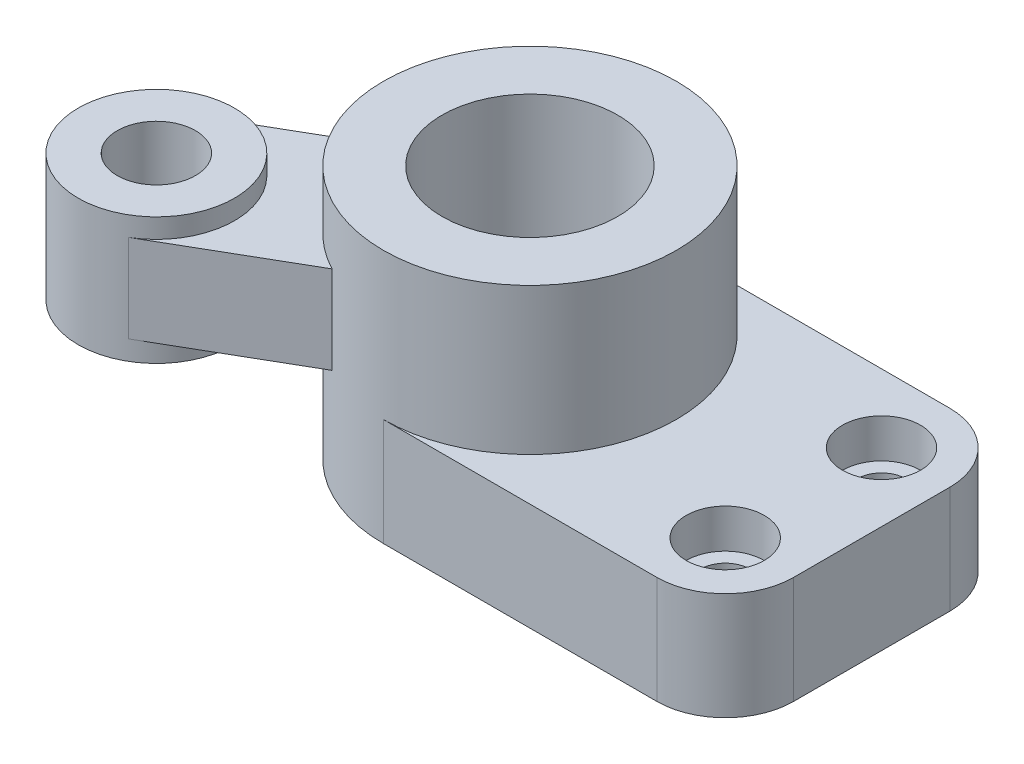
ISO-10303-21;
HEADER;
FILE_DESCRIPTION(('STEP AP214'),'2;1');
FILE_NAME('part.step','',(''),(''),'','','');
FILE_SCHEMA(('AUTOMOTIVE_DESIGN { 1 0 10303 214 1 1 1 1 }'));
ENDSEC;
DATA;
#1=APPLICATION_CONTEXT('core data for automotive mechanical design processes');
#2=APPLICATION_PROTOCOL_DEFINITION('international standard','automotive_design',2000,#1);
#3=PRODUCT_CONTEXT('',#1,'mechanical');
#4=PRODUCT('Part','Part','',(#3));
#5=PRODUCT_RELATED_PRODUCT_CATEGORY('part','',(#4));
#6=PRODUCT_DEFINITION_FORMATION('','',#4);
#7=PRODUCT_DEFINITION_CONTEXT('part definition',#1,'design');
#8=PRODUCT_DEFINITION('design','',#6,#7);
#9=PRODUCT_DEFINITION_SHAPE('','',#8);
#10=(LENGTH_UNIT() NAMED_UNIT(*) SI_UNIT(.MILLI.,.METRE.));
#11=(NAMED_UNIT(*) PLANE_ANGLE_UNIT() SI_UNIT($,.RADIAN.));
#12=(NAMED_UNIT(*) SI_UNIT($,.STERADIAN.) SOLID_ANGLE_UNIT());
#13=UNCERTAINTY_MEASURE_WITH_UNIT(LENGTH_MEASURE(1.E-05),#10,'distance_accuracy_value','');
#14=(GEOMETRIC_REPRESENTATION_CONTEXT(3) GLOBAL_UNCERTAINTY_ASSIGNED_CONTEXT((#13)) GLOBAL_UNIT_ASSIGNED_CONTEXT((#10,
#11,#12)) REPRESENTATION_CONTEXT('',''));
#15=CARTESIAN_POINT('',(0.,0.,0.));
#16=DIRECTION('',(0.,0.,1.));
#17=DIRECTION('',(1.,0.,0.));
#18=AXIS2_PLACEMENT_3D('',#15,#16,#17);
#19=CARTESIAN_POINT('',(0.,11.,0.));
#20=DIRECTION('',(0.,-1.,0.));
#21=DIRECTION('',(0.,0.,-1.));
#22=AXIS2_PLACEMENT_3D('',#19,#20,#21);
#23=CYLINDRICAL_SURFACE('',#22,15.);
#24=CARTESIAN_POINT('',(0.,26.,0.));
#25=DIRECTION('',(0.,1.,0.));
#26=DIRECTION('',(0.,0.,1.));
#27=AXIS2_PLACEMENT_3D('',#24,#25,#26);
#28=CIRCLE('',#27,15.);
#29=CARTESIAN_POINT('',(0.,26.,15.));
#30=VERTEX_POINT('',#29);
#31=EDGE_CURVE('E152',#30,#30,#28,.T.);
#32=ORIENTED_EDGE('',*,*,#31,.F.);
#33=EDGE_LOOP('',(#32));
#34=FACE_BOUND('',#33,.T.);
#35=CARTESIAN_POINT('',(0.,0.,0.));
#36=DIRECTION('',(0.,1.,0.));
#37=DIRECTION('',(0.,0.,1.));
#38=AXIS2_PLACEMENT_3D('',#35,#36,#37);
#39=CIRCLE('',#38,15.);
#40=CARTESIAN_POINT('',(0.,0.,-15.));
#41=VERTEX_POINT('',#40);
#42=CARTESIAN_POINT('',(0.,0.,15.));
#43=VERTEX_POINT('',#42);
#44=EDGE_CURVE('E222',#41,#43,#39,.T.);
#45=ORIENTED_EDGE('',*,*,#44,.T.);
#46=DIRECTION('',(0.,-1.,0.));
#47=VECTOR('',#46,1.);
#48=CARTESIAN_POINT('',(0.,11.,15.));
#49=LINE('',#48,#47);
#50=CARTESIAN_POINT('',(0.,11.,15.));
#51=VERTEX_POINT('',#50);
#52=EDGE_CURVE('E166',#51,#43,#49,.T.);
#53=ORIENTED_EDGE('',*,*,#52,.F.);
#54=CARTESIAN_POINT('',(0.,11.,0.));
#55=DIRECTION('',(0.,1.,0.));
#56=DIRECTION('',(0.,0.,1.));
#57=AXIS2_PLACEMENT_3D('',#54,#55,#56);
#58=CIRCLE('',#57,15.);
#59=CARTESIAN_POINT('',(0.,11.,-15.));
#60=VERTEX_POINT('',#59);
#61=EDGE_CURVE('E151',#51,#60,#58,.T.);
#62=ORIENTED_EDGE('',*,*,#61,.T.);
#63=DIRECTION('',(0.,-1.,0.));
#64=VECTOR('',#63,1.);
#65=CARTESIAN_POINT('',(0.,11.,-15.));
#66=LINE('',#65,#64);
#67=EDGE_CURVE('E170',#60,#41,#66,.T.);
#68=ORIENTED_EDGE('',*,*,#67,.T.);
#69=EDGE_LOOP('',(#45,#53,#62,#68));
#70=FACE_BOUND('',#69,.T.);
#71=CARTESIAN_POINT('',(0.,11.,0.));
#72=DIRECTION('',(0.,-1.,0.));
#73=DIRECTION('',(0.,0.,1.));
#74=AXIS2_PLACEMENT_3D('',#71,#72,#73);
#75=CIRCLE('',#74,15.);
#76=CARTESIAN_POINT('',(-6.98874980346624,11.,13.2724291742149));
#77=VERTEX_POINT('',#76);
#78=CARTESIAN_POINT('',(-14.9886357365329,11.,-0.583779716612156));
#79=VERTEX_POINT('',#78);
#80=EDGE_CURVE('E146',#77,#79,#75,.T.);
#81=ORIENTED_EDGE('',*,*,#80,.T.);
#82=DIRECTION('',(0.,-1.,0.));
#83=VECTOR('',#82,1.);
#84=CARTESIAN_POINT('',(-14.9886357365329,50.2035495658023,-0.583779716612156));
#85=LINE('',#84,#83);
#86=CARTESIAN_POINT('',(-14.9886357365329,20.,-0.583779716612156));
#87=VERTEX_POINT('',#86);
#88=EDGE_CURVE('E137',#87,#79,#85,.T.);
#89=ORIENTED_EDGE('',*,*,#88,.F.);
#90=CARTESIAN_POINT('',(0.,20.,0.));
#91=DIRECTION('',(0.,1.,0.));
#92=DIRECTION('',(0.,0.,1.));
#93=AXIS2_PLACEMENT_3D('',#90,#91,#92);
#94=CIRCLE('',#93,15.);
#95=CARTESIAN_POINT('',(-6.98874980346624,20.,13.2724291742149));
#96=VERTEX_POINT('',#95);
#97=EDGE_CURVE('E134',#96,#87,#94,.F.);
#98=ORIENTED_EDGE('',*,*,#97,.F.);
#99=DIRECTION('',(0.,-1.,0.));
#100=VECTOR('',#99,1.);
#101=CARTESIAN_POINT('',(-6.98874980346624,50.2035495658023,13.2724291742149));
#102=LINE('',#101,#100);
#103=EDGE_CURVE('E143',#96,#77,#102,.T.);
#104=ORIENTED_EDGE('',*,*,#103,.T.);
#105=EDGE_LOOP('',(#81,#89,#98,#104));
#106=FACE_BOUND('',#105,.T.);
#107=ADVANCED_FACE('F32',(#34,#70,#106),#23,.T.);
#108=CARTESIAN_POINT('',(28.,11.,8.));
#109=DIRECTION('',(0.,-1.,0.));
#110=DIRECTION('',(0.,0.,-1.));
#111=AXIS2_PLACEMENT_3D('',#108,#109,#110);
#112=CYLINDRICAL_SURFACE('',#111,2.5);
#113=CARTESIAN_POINT('',(28.,0.,8.));
#114=DIRECTION('',(0.,1.,0.));
#115=DIRECTION('',(0.,0.,-1.));
#116=AXIS2_PLACEMENT_3D('',#113,#114,#115);
#117=CIRCLE('',#116,2.5);
#118=CARTESIAN_POINT('',(28.,0.,5.5));
#119=VERTEX_POINT('',#118);
#120=EDGE_CURVE('E227',#119,#119,#117,.T.);
#121=ORIENTED_EDGE('',*,*,#120,.F.);
#122=EDGE_LOOP('',(#121));
#123=FACE_BOUND('',#122,.T.);
#124=CARTESIAN_POINT('',(28.,7.,8.));
#125=DIRECTION('',(0.,1.,0.));
#126=DIRECTION('',(0.,0.,1.));
#127=AXIS2_PLACEMENT_3D('',#124,#125,#126);
#128=CIRCLE('',#127,2.5);
#129=CARTESIAN_POINT('',(28.,7.,10.5));
#130=VERTEX_POINT('',#129);
#131=EDGE_CURVE('E164',#130,#130,#128,.T.);
#132=ORIENTED_EDGE('',*,*,#131,.T.);
#133=EDGE_LOOP('',(#132));
#134=FACE_BOUND('',#133,.T.);
#135=ADVANCED_FACE('F259',(#123,#134),#112,.F.);
#136=CARTESIAN_POINT('',(28.,11.,-8.));
#137=DIRECTION('',(0.,-1.,0.));
#138=DIRECTION('',(0.,0.,-1.));
#139=AXIS2_PLACEMENT_3D('',#136,#137,#138);
#140=CYLINDRICAL_SURFACE('',#139,2.5);
#141=CARTESIAN_POINT('',(28.,0.,-8.));
#142=DIRECTION('',(0.,1.,0.));
#143=DIRECTION('',(0.,0.,1.));
#144=AXIS2_PLACEMENT_3D('',#141,#142,#143);
#145=CIRCLE('',#144,2.5);
#146=CARTESIAN_POINT('',(28.,0.,-5.5));
#147=VERTEX_POINT('',#146);
#148=EDGE_CURVE('E232',#147,#147,#145,.T.);
#149=ORIENTED_EDGE('',*,*,#148,.F.);
#150=EDGE_LOOP('',(#149));
#151=FACE_BOUND('',#150,.T.);
#152=CARTESIAN_POINT('',(28.,7.,-8.));
#153=DIRECTION('',(0.,1.,0.));
#154=DIRECTION('',(0.,0.,1.));
#155=AXIS2_PLACEMENT_3D('',#152,#153,#154);
#156=CIRCLE('',#155,2.5);
#157=CARTESIAN_POINT('',(28.,7.,-5.5));
#158=VERTEX_POINT('',#157);
#159=EDGE_CURVE('E225',#158,#158,#156,.T.);
#160=ORIENTED_EDGE('',*,*,#159,.T.);
#161=EDGE_LOOP('',(#160));
#162=FACE_BOUND('',#161,.T.);
#163=ADVANCED_FACE('F265',(#151,#162),#140,.F.);
#164=CARTESIAN_POINT('',(0.,11.,0.));
#165=DIRECTION('',(0.,1.,0.));
#166=DIRECTION('',(0.,0.,1.));
#167=AXIS2_PLACEMENT_3D('',#164,#165,#166);
#168=PLANE('',#167);
#169=DIRECTION('',(0.,0.,-1.));
#170=VECTOR('',#169,1.);
#171=CARTESIAN_POINT('',(35.,11.,-15.));
#172=LINE('',#171,#170);
#173=CARTESIAN_POINT('',(35.,11.,8.));
#174=VERTEX_POINT('',#173);
#175=CARTESIAN_POINT('',(35.,11.,-8.));
#176=VERTEX_POINT('',#175);
#177=EDGE_CURVE('E175',#174,#176,#172,.T.);
#178=ORIENTED_EDGE('',*,*,#177,.T.);
#179=CARTESIAN_POINT('',(28.,11.,-8.));
#180=DIRECTION('',(0.,1.,0.));
#181=DIRECTION('',(0.,0.,1.));
#182=AXIS2_PLACEMENT_3D('',#179,#180,#181);
#183=CIRCLE('',#182,7.);
#184=CARTESIAN_POINT('',(28.,11.,-15.));
#185=VERTEX_POINT('',#184);
#186=EDGE_CURVE('E40',#176,#185,#183,.T.);
#187=ORIENTED_EDGE('',*,*,#186,.T.);
#188=DIRECTION('',(-1.,0.,0.));
#189=VECTOR('',#188,1.);
#190=CARTESIAN_POINT('',(0.,11.,-15.));
#191=LINE('',#190,#189);
#192=EDGE_CURVE('E183',#185,#60,#191,.T.);
#193=ORIENTED_EDGE('',*,*,#192,.T.);
#194=ORIENTED_EDGE('',*,*,#61,.F.);
#195=DIRECTION('',(1.,0.,0.));
#196=VECTOR('',#195,1.);
#197=CARTESIAN_POINT('',(0.,11.,15.));
#198=LINE('',#197,#196);
#199=CARTESIAN_POINT('',(28.,11.,15.));
#200=VERTEX_POINT('',#199);
#201=EDGE_CURVE('E173',#51,#200,#198,.T.);
#202=ORIENTED_EDGE('',*,*,#201,.T.);
#203=CARTESIAN_POINT('',(28.,11.,8.));
#204=DIRECTION('',(0.,1.,0.));
#205=DIRECTION('',(0.,0.,1.));
#206=AXIS2_PLACEMENT_3D('',#203,#204,#205);
#207=CIRCLE('',#206,7.);
#208=EDGE_CURVE('E196',#200,#174,#207,.T.);
#209=ORIENTED_EDGE('',*,*,#208,.T.);
#210=EDGE_LOOP('',(#178,#187,#193,#194,#202,#209));
#211=FACE_BOUND('',#210,.T.);
#212=CARTESIAN_POINT('',(28.,11.,8.));
#213=DIRECTION('',(0.,1.,0.));
#214=DIRECTION('',(0.,0.,1.));
#215=AXIS2_PLACEMENT_3D('',#212,#213,#214);
#216=CIRCLE('',#215,4.);
#217=CARTESIAN_POINT('',(28.,11.,12.));
#218=VERTEX_POINT('',#217);
#219=EDGE_CURVE('E155',#218,#218,#216,.T.);
#220=ORIENTED_EDGE('',*,*,#219,.F.);
#221=EDGE_LOOP('',(#220));
#222=FACE_BOUND('',#221,.T.);
#223=CARTESIAN_POINT('',(28.,11.,-8.));
#224=DIRECTION('',(0.,1.,0.));
#225=DIRECTION('',(0.,0.,1.));
#226=AXIS2_PLACEMENT_3D('',#223,#224,#225);
#227=CIRCLE('',#226,4.);
#228=CARTESIAN_POINT('',(28.,11.,-4.));
#229=VERTEX_POINT('',#228);
#230=EDGE_CURVE('E235',#229,#229,#227,.T.);
#231=ORIENTED_EDGE('',*,*,#230,.F.);
#232=EDGE_LOOP('',(#231));
#233=FACE_BOUND('',#232,.T.);
#234=ADVANCED_FACE('F200',(#211,#222,#233),#168,.T.);
#235=CARTESIAN_POINT('',(0.,0.,0.));
#236=DIRECTION('',(0.,1.,0.));
#237=DIRECTION('',(0.,0.,1.));
#238=AXIS2_PLACEMENT_3D('',#235,#236,#237);
#239=PLANE('',#238);
#240=ORIENTED_EDGE('',*,*,#148,.T.);
#241=EDGE_LOOP('',(#240));
#242=FACE_BOUND('',#241,.T.);
#243=DIRECTION('',(-1.,0.,0.));
#244=VECTOR('',#243,1.);
#245=CARTESIAN_POINT('',(0.,0.,-15.));
#246=LINE('',#245,#244);
#247=CARTESIAN_POINT('',(28.,0.,-15.));
#248=VERTEX_POINT('',#247);
#249=EDGE_CURVE('E176',#248,#41,#246,.T.);
#250=ORIENTED_EDGE('',*,*,#249,.F.);
#251=CARTESIAN_POINT('',(28.,0.,-8.));
#252=DIRECTION('',(0.,1.,0.));
#253=DIRECTION('',(0.,0.,1.));
#254=AXIS2_PLACEMENT_3D('',#251,#252,#253);
#255=CIRCLE('',#254,7.);
#256=CARTESIAN_POINT('',(35.,0.,-8.));
#257=VERTEX_POINT('',#256);
#258=EDGE_CURVE('E190',#248,#257,#255,.F.);
#259=ORIENTED_EDGE('',*,*,#258,.T.);
#260=DIRECTION('',(0.,0.,-1.));
#261=VECTOR('',#260,1.);
#262=CARTESIAN_POINT('',(35.,0.,-15.));
#263=LINE('',#262,#261);
#264=CARTESIAN_POINT('',(35.,0.,8.));
#265=VERTEX_POINT('',#264);
#266=EDGE_CURVE('E215',#265,#257,#263,.T.);
#267=ORIENTED_EDGE('',*,*,#266,.F.);
#268=CARTESIAN_POINT('',(28.,0.,8.));
#269=DIRECTION('',(0.,1.,0.));
#270=DIRECTION('',(0.,0.,1.));
#271=AXIS2_PLACEMENT_3D('',#268,#269,#270);
#272=CIRCLE('',#271,7.);
#273=CARTESIAN_POINT('',(28.,0.,15.));
#274=VERTEX_POINT('',#273);
#275=EDGE_CURVE('E188',#265,#274,#272,.F.);
#276=ORIENTED_EDGE('',*,*,#275,.T.);
#277=DIRECTION('',(1.,0.,0.));
#278=VECTOR('',#277,1.);
#279=CARTESIAN_POINT('',(0.,0.,15.));
#280=LINE('',#279,#278);
#281=EDGE_CURVE('E219',#43,#274,#280,.T.);
#282=ORIENTED_EDGE('',*,*,#281,.F.);
#283=ORIENTED_EDGE('',*,*,#44,.F.);
#284=EDGE_LOOP('',(#250,#259,#267,#276,#282,#283));
#285=FACE_BOUND('',#284,.T.);
#286=CARTESIAN_POINT('',(0.,0.,0.));
#287=DIRECTION('',(0.,1.,0.));
#288=DIRECTION('',(0.,0.,1.));
#289=AXIS2_PLACEMENT_3D('',#286,#287,#288);
#290=CIRCLE('',#289,9.);
#291=CARTESIAN_POINT('',(0.,0.,9.));
#292=VERTEX_POINT('',#291);
#293=EDGE_CURVE('E244',#292,#292,#290,.T.);
#294=ORIENTED_EDGE('',*,*,#293,.T.);
#295=EDGE_LOOP('',(#294));
#296=FACE_BOUND('',#295,.T.);
#297=ORIENTED_EDGE('',*,*,#120,.T.);
#298=EDGE_LOOP('',(#297));
#299=FACE_BOUND('',#298,.T.);
#300=ADVANCED_FACE('F213',(#242,#285,#296,#299),#239,.F.);
#301=CARTESIAN_POINT('',(0.,11.,15.));
#302=DIRECTION('',(0.,0.,-1.));
#303=DIRECTION('',(-1.,0.,0.));
#304=AXIS2_PLACEMENT_3D('',#301,#302,#303);
#305=PLANE('',#304);
#306=ORIENTED_EDGE('',*,*,#281,.T.);
#307=DIRECTION('',(0.,-1.,0.));
#308=VECTOR('',#307,1.);
#309=CARTESIAN_POINT('',(28.,11.,15.));
#310=LINE('',#309,#308);
#311=EDGE_CURVE('E11',#274,#200,#310,.F.);
#312=ORIENTED_EDGE('',*,*,#311,.T.);
#313=ORIENTED_EDGE('',*,*,#201,.F.);
#314=ORIENTED_EDGE('',*,*,#52,.T.);
#315=EDGE_LOOP('',(#306,#312,#313,#314));
#316=FACE_BOUND('',#315,.T.);
#317=ADVANCED_FACE('F250',(#316),#305,.F.);
#318=CARTESIAN_POINT('',(35.,11.,-15.));
#319=DIRECTION('',(-1.,0.,0.));
#320=DIRECTION('',(0.,0.,1.));
#321=AXIS2_PLACEMENT_3D('',#318,#319,#320);
#322=PLANE('',#321);
#323=ORIENTED_EDGE('',*,*,#266,.T.);
#324=DIRECTION('',(0.,-1.,0.));
#325=VECTOR('',#324,1.);
#326=CARTESIAN_POINT('',(35.,11.,-8.));
#327=LINE('',#326,#325);
#328=EDGE_CURVE('E53',#257,#176,#327,.F.);
#329=ORIENTED_EDGE('',*,*,#328,.T.);
#330=ORIENTED_EDGE('',*,*,#177,.F.);
#331=DIRECTION('',(0.,-1.,0.));
#332=VECTOR('',#331,1.);
#333=CARTESIAN_POINT('',(35.,11.,8.));
#334=LINE('',#333,#332);
#335=EDGE_CURVE('E192',#174,#265,#334,.T.);
#336=ORIENTED_EDGE('',*,*,#335,.T.);
#337=EDGE_LOOP('',(#323,#329,#330,#336));
#338=FACE_BOUND('',#337,.T.);
#339=ADVANCED_FACE('F217',(#338),#322,.F.);
#340=CARTESIAN_POINT('',(0.,11.,-15.));
#341=DIRECTION('',(0.,0.,1.));
#342=DIRECTION('',(1.,0.,0.));
#343=AXIS2_PLACEMENT_3D('',#340,#341,#342);
#344=PLANE('',#343);
#345=ORIENTED_EDGE('',*,*,#192,.F.);
#346=DIRECTION('',(0.,-1.,0.));
#347=VECTOR('',#346,1.);
#348=CARTESIAN_POINT('',(28.,11.,-15.));
#349=LINE('',#348,#347);
#350=EDGE_CURVE('E169',#185,#248,#349,.T.);
#351=ORIENTED_EDGE('',*,*,#350,.T.);
#352=ORIENTED_EDGE('',*,*,#249,.T.);
#353=ORIENTED_EDGE('',*,*,#67,.F.);
#354=EDGE_LOOP('',(#345,#351,#352,#353));
#355=FACE_BOUND('',#354,.T.);
#356=ADVANCED_FACE('F207',(#355),#344,.F.);
#357=CARTESIAN_POINT('',(0.,11.,0.));
#358=DIRECTION('',(0.,-1.,0.));
#359=DIRECTION('',(0.,0.,-1.));
#360=AXIS2_PLACEMENT_3D('',#357,#358,#359);
#361=CYLINDRICAL_SURFACE('',#360,9.);
#362=ORIENTED_EDGE('',*,*,#293,.F.);
#363=EDGE_LOOP('',(#362));
#364=FACE_BOUND('',#363,.T.);
#365=CARTESIAN_POINT('',(0.,26.,0.));
#366=DIRECTION('',(0.,1.,0.));
#367=DIRECTION('',(0.,0.,1.));
#368=AXIS2_PLACEMENT_3D('',#365,#366,#367);
#369=CIRCLE('',#368,9.);
#370=CARTESIAN_POINT('',(0.,26.,9.));
#371=VERTEX_POINT('',#370);
#372=EDGE_CURVE('E148',#371,#371,#369,.T.);
#373=ORIENTED_EDGE('',*,*,#372,.T.);
#374=EDGE_LOOP('',(#373));
#375=FACE_BOUND('',#374,.T.);
#376=ADVANCED_FACE('F276',(#364,#375),#361,.F.);
#377=CARTESIAN_POINT('',(28.,7.,-8.));
#378=DIRECTION('',(0.,1.,0.));
#379=DIRECTION('',(0.,0.,1.));
#380=AXIS2_PLACEMENT_3D('',#377,#378,#379);
#381=CYLINDRICAL_SURFACE('',#380,4.);
#382=CARTESIAN_POINT('',(28.,7.,-8.));
#383=DIRECTION('',(0.,1.,0.));
#384=DIRECTION('',(0.,0.,1.));
#385=AXIS2_PLACEMENT_3D('',#382,#383,#384);
#386=CIRCLE('',#385,4.);
#387=CARTESIAN_POINT('',(28.,7.,-4.));
#388=VERTEX_POINT('',#387);
#389=EDGE_CURVE('E228',#388,#388,#386,.T.);
#390=ORIENTED_EDGE('',*,*,#389,.F.);
#391=EDGE_LOOP('',(#390));
#392=FACE_BOUND('',#391,.T.);
#393=ORIENTED_EDGE('',*,*,#230,.T.);
#394=EDGE_LOOP('',(#393));
#395=FACE_BOUND('',#394,.T.);
#396=ADVANCED_FACE('F284',(#392,#395),#381,.F.);
#397=CARTESIAN_POINT('',(28.,7.,-8.));
#398=DIRECTION('',(0.,1.,0.));
#399=DIRECTION('',(0.,0.,1.));
#400=AXIS2_PLACEMENT_3D('',#397,#398,#399);
#401=PLANE('',#400);
#402=ORIENTED_EDGE('',*,*,#159,.F.);
#403=EDGE_LOOP('',(#402));
#404=FACE_BOUND('',#403,.T.);
#405=ORIENTED_EDGE('',*,*,#389,.T.);
#406=EDGE_LOOP('',(#405));
#407=FACE_BOUND('',#406,.T.);
#408=ADVANCED_FACE('F291',(#404,#407),#401,.T.);
#409=CARTESIAN_POINT('',(28.,7.,8.));
#410=DIRECTION('',(0.,1.,0.));
#411=DIRECTION('',(0.,0.,1.));
#412=AXIS2_PLACEMENT_3D('',#409,#410,#411);
#413=CYLINDRICAL_SURFACE('',#412,4.);
#414=CARTESIAN_POINT('',(28.,7.,8.));
#415=DIRECTION('',(0.,1.,0.));
#416=DIRECTION('',(0.,0.,1.));
#417=AXIS2_PLACEMENT_3D('',#414,#415,#416);
#418=CIRCLE('',#417,4.);
#419=CARTESIAN_POINT('',(28.,7.,12.));
#420=VERTEX_POINT('',#419);
#421=EDGE_CURVE('E159',#420,#420,#418,.T.);
#422=ORIENTED_EDGE('',*,*,#421,.F.);
#423=EDGE_LOOP('',(#422));
#424=FACE_BOUND('',#423,.T.);
#425=ORIENTED_EDGE('',*,*,#219,.T.);
#426=EDGE_LOOP('',(#425));
#427=FACE_BOUND('',#426,.T.);
#428=ADVANCED_FACE('F295',(#424,#427),#413,.F.);
#429=CARTESIAN_POINT('',(28.,7.,8.));
#430=DIRECTION('',(0.,1.,0.));
#431=DIRECTION('',(0.,0.,1.));
#432=AXIS2_PLACEMENT_3D('',#429,#430,#431);
#433=PLANE('',#432);
#434=ORIENTED_EDGE('',*,*,#131,.F.);
#435=EDGE_LOOP('',(#434));
#436=FACE_BOUND('',#435,.T.);
#437=ORIENTED_EDGE('',*,*,#421,.T.);
#438=EDGE_LOOP('',(#437));
#439=FACE_BOUND('',#438,.T.);
#440=ADVANCED_FACE('F299',(#436,#439),#433,.T.);
#441=CARTESIAN_POINT('',(0.,26.,0.));
#442=DIRECTION('',(0.,1.,0.));
#443=DIRECTION('',(0.,0.,1.));
#444=AXIS2_PLACEMENT_3D('',#441,#442,#443);
#445=PLANE('',#444);
#446=ORIENTED_EDGE('',*,*,#31,.T.);
#447=EDGE_LOOP('',(#446));
#448=FACE_BOUND('',#447,.T.);
#449=ORIENTED_EDGE('',*,*,#372,.F.);
#450=EDGE_LOOP('',(#449));
#451=FACE_BOUND('',#450,.T.);
#452=ADVANCED_FACE('F303',(#448,#451),#445,.T.);
#453=CARTESIAN_POINT('',(-20.2117711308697,50.2035495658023,20.9067440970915));
#454=DIRECTION('',(-0.500000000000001,0.,-0.866025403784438));
#455=DIRECTION('',(-0.866025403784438,0.,0.500000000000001));
#456=AXIS2_PLACEMENT_3D('',#453,#454,#455);
#457=PLANE('',#456);
#458=DIRECTION('',(0.866025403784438,0.,-0.500000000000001));
#459=VECTOR('',#458,1.);
#460=CARTESIAN_POINT('',(-20.2117711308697,20.,20.9067440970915));
#461=LINE('',#460,#459);
#462=CARTESIAN_POINT('',(-20.2117711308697,20.,20.9067440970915));
#463=VERTEX_POINT('',#462);
#464=EDGE_CURVE('E120',#463,#96,#461,.T.);
#465=ORIENTED_EDGE('',*,*,#464,.F.);
#466=DIRECTION('',(0.,-1.,0.));
#467=VECTOR('',#466,1.);
#468=CARTESIAN_POINT('',(-20.2117711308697,50.2035495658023,20.9067440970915));
#469=LINE('',#468,#467);
#470=CARTESIAN_POINT('',(-20.2117711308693,11.,20.9067440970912));
#471=VERTEX_POINT('',#470);
#472=EDGE_CURVE('E116',#463,#471,#469,.T.);
#473=ORIENTED_EDGE('',*,*,#472,.T.);
#474=DIRECTION('',(0.866025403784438,0.,-0.500000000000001));
#475=VECTOR('',#474,1.);
#476=CARTESIAN_POINT('',(-20.2117711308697,11.,20.9067440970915));
#477=LINE('',#476,#475);
#478=EDGE_CURVE('E142',#471,#77,#477,.T.);
#479=ORIENTED_EDGE('',*,*,#478,.T.);
#480=ORIENTED_EDGE('',*,*,#103,.F.);
#481=EDGE_LOOP('',(#465,#473,#479,#480));
#482=FACE_BOUND('',#481,.T.);
#483=ADVANCED_FACE('F307',(#482),#457,.F.);
#484=CARTESIAN_POINT('',(-28.2116570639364,50.2035495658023,7.05053520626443));
#485=DIRECTION('',(0.500000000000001,0.,0.866025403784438));
#486=DIRECTION('',(0.866025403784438,0.,-0.500000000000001));
#487=AXIS2_PLACEMENT_3D('',#484,#485,#486);
#488=PLANE('',#487);
#489=DIRECTION('',(-0.866025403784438,0.,0.500000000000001));
#490=VECTOR('',#489,1.);
#491=CARTESIAN_POINT('',(-28.2116570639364,20.,7.05053520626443));
#492=LINE('',#491,#490);
#493=CARTESIAN_POINT('',(-28.211657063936,20.,7.05053520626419));
#494=VERTEX_POINT('',#493);
#495=EDGE_CURVE('E121',#87,#494,#492,.T.);
#496=ORIENTED_EDGE('',*,*,#495,.F.);
#497=ORIENTED_EDGE('',*,*,#88,.T.);
#498=DIRECTION('',(-0.866025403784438,0.,0.500000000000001));
#499=VECTOR('',#498,1.);
#500=CARTESIAN_POINT('',(-28.2116570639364,11.,7.05053520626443));
#501=LINE('',#500,#499);
#502=CARTESIAN_POINT('',(-28.211657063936,11.,7.05053520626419));
#503=VERTEX_POINT('',#502);
#504=EDGE_CURVE('E127',#79,#503,#501,.T.);
#505=ORIENTED_EDGE('',*,*,#504,.T.);
#506=DIRECTION('',(0.,-1.,0.));
#507=VECTOR('',#506,1.);
#508=CARTESIAN_POINT('',(-28.2116570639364,50.2035495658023,7.05053520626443));
#509=LINE('',#508,#507);
#510=EDGE_CURVE('E113',#494,#503,#509,.T.);
#511=ORIENTED_EDGE('',*,*,#510,.F.);
#512=EDGE_LOOP('',(#496,#497,#505,#511));
#513=FACE_BOUND('',#512,.T.);
#514=ADVANCED_FACE('F124',(#513),#488,.F.);
#515=CARTESIAN_POINT('',(-24.2487113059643,11.,14.));
#516=DIRECTION('',(0.,1.,0.));
#517=DIRECTION('',(0.,0.,1.));
#518=AXIS2_PLACEMENT_3D('',#515,#516,#517);
#519=PLANE('',#518);
#520=CARTESIAN_POINT('',(-24.2487113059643,11.,14.));
#521=DIRECTION('',(0.,-1.,0.));
#522=DIRECTION('',(0.,0.,1.));
#523=AXIS2_PLACEMENT_3D('',#520,#521,#522);
#524=CIRCLE('',#523,7.99999999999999);
#525=EDGE_CURVE('E129',#503,#471,#524,.T.);
#526=ORIENTED_EDGE('',*,*,#525,.F.);
#527=ORIENTED_EDGE('',*,*,#504,.F.);
#528=ORIENTED_EDGE('',*,*,#80,.F.);
#529=ORIENTED_EDGE('',*,*,#478,.F.);
#530=EDGE_LOOP('',(#526,#527,#528,#529));
#531=FACE_BOUND('',#530,.T.);
#532=ADVANCED_FACE('F311',(#531),#519,.F.);
#533=CARTESIAN_POINT('',(0.,20.,0.));
#534=DIRECTION('',(0.,1.,0.));
#535=DIRECTION('',(0.,0.,1.));
#536=AXIS2_PLACEMENT_3D('',#533,#534,#535);
#537=PLANE('',#536);
#538=ORIENTED_EDGE('',*,*,#495,.T.);
#539=CARTESIAN_POINT('',(-24.2487113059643,20.,14.));
#540=DIRECTION('',(0.,1.,0.));
#541=DIRECTION('',(0.,0.,1.));
#542=AXIS2_PLACEMENT_3D('',#539,#540,#541);
#543=CIRCLE('',#542,7.99999999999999);
#544=EDGE_CURVE('E110',#494,#463,#543,.F.);
#545=ORIENTED_EDGE('',*,*,#544,.T.);
#546=ORIENTED_EDGE('',*,*,#464,.T.);
#547=ORIENTED_EDGE('',*,*,#97,.T.);
#548=EDGE_LOOP('',(#538,#545,#546,#547));
#549=FACE_BOUND('',#548,.T.);
#550=ADVANCED_FACE('F132',(#549),#537,.T.);
#551=CARTESIAN_POINT('',(-24.2487113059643,44.6274169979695,14.));
#552=DIRECTION('',(0.,-1.,0.));
#553=DIRECTION('',(0.,0.,-1.));
#554=AXIS2_PLACEMENT_3D('',#551,#552,#553);
#555=CYLINDRICAL_SURFACE('',#554,8.);
#556=CARTESIAN_POINT('',(-24.2487113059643,22.,14.));
#557=DIRECTION('',(0.,1.,0.));
#558=DIRECTION('',(0.,0.,1.));
#559=AXIS2_PLACEMENT_3D('',#556,#557,#558);
#560=CIRCLE('',#559,8.);
#561=CARTESIAN_POINT('',(-24.2487113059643,22.,22.));
#562=VERTEX_POINT('',#561);
#563=EDGE_CURVE('E130',#562,#562,#560,.T.);
#564=ORIENTED_EDGE('',*,*,#563,.F.);
#565=EDGE_LOOP('',(#564));
#566=FACE_BOUND('',#565,.T.);
#567=CARTESIAN_POINT('',(-24.2487113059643,9.,14.));
#568=DIRECTION('',(0.,1.,0.));
#569=DIRECTION('',(0.,0.,1.));
#570=AXIS2_PLACEMENT_3D('',#567,#568,#569);
#571=CIRCLE('',#570,8.);
#572=CARTESIAN_POINT('',(-24.2487113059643,9.,22.));
#573=VERTEX_POINT('',#572);
#574=EDGE_CURVE('E341',#573,#573,#571,.T.);
#575=ORIENTED_EDGE('',*,*,#574,.T.);
#576=EDGE_LOOP('',(#575));
#577=FACE_BOUND('',#576,.T.);
#578=ORIENTED_EDGE('',*,*,#510,.T.);
#579=ORIENTED_EDGE('',*,*,#525,.T.);
#580=ORIENTED_EDGE('',*,*,#472,.F.);
#581=ORIENTED_EDGE('',*,*,#544,.F.);
#582=EDGE_LOOP('',(#578,#579,#580,#581));
#583=FACE_BOUND('',#582,.T.);
#584=ADVANCED_FACE('F112',(#566,#577,#583),#555,.T.);
#585=CARTESIAN_POINT('',(-24.2487113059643,9.,14.));
#586=DIRECTION('',(0.,1.,0.));
#587=DIRECTION('',(0.,0.,1.));
#588=AXIS2_PLACEMENT_3D('',#585,#586,#587);
#589=PLANE('',#588);
#590=ORIENTED_EDGE('',*,*,#574,.F.);
#591=EDGE_LOOP('',(#590));
#592=FACE_BOUND('',#591,.T.);
#593=CARTESIAN_POINT('',(-24.2487113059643,9.,14.));
#594=DIRECTION('',(0.,1.,0.));
#595=DIRECTION('',(0.,0.,1.));
#596=AXIS2_PLACEMENT_3D('',#593,#594,#595);
#597=CIRCLE('',#596,4.);
#598=CARTESIAN_POINT('',(-24.2487113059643,9.,18.));
#599=VERTEX_POINT('',#598);
#600=EDGE_CURVE('E344',#599,#599,#597,.T.);
#601=ORIENTED_EDGE('',*,*,#600,.T.);
#602=EDGE_LOOP('',(#601));
#603=FACE_BOUND('',#602,.T.);
#604=ADVANCED_FACE('F322',(#592,#603),#589,.F.);
#605=CARTESIAN_POINT('',(-24.2487113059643,44.6274169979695,14.));
#606=DIRECTION('',(0.,-1.,0.));
#607=DIRECTION('',(0.,0.,-1.));
#608=AXIS2_PLACEMENT_3D('',#605,#606,#607);
#609=CYLINDRICAL_SURFACE('',#608,4.);
#610=ORIENTED_EDGE('',*,*,#600,.F.);
#611=EDGE_LOOP('',(#610));
#612=FACE_BOUND('',#611,.T.);
#613=CARTESIAN_POINT('',(-24.2487113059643,22.,14.));
#614=DIRECTION('',(0.,1.,0.));
#615=DIRECTION('',(0.,0.,1.));
#616=AXIS2_PLACEMENT_3D('',#613,#614,#615);
#617=CIRCLE('',#616,4.);
#618=CARTESIAN_POINT('',(-24.2487113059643,22.,18.));
#619=VERTEX_POINT('',#618);
#620=EDGE_CURVE('E338',#619,#619,#617,.T.);
#621=ORIENTED_EDGE('',*,*,#620,.T.);
#622=EDGE_LOOP('',(#621));
#623=FACE_BOUND('',#622,.T.);
#624=ADVANCED_FACE('F326',(#612,#623),#609,.F.);
#625=CARTESIAN_POINT('',(0.,22.,0.));
#626=DIRECTION('',(0.,1.,0.));
#627=DIRECTION('',(0.,0.,1.));
#628=AXIS2_PLACEMENT_3D('',#625,#626,#627);
#629=PLANE('',#628);
#630=ORIENTED_EDGE('',*,*,#620,.F.);
#631=EDGE_LOOP('',(#630));
#632=FACE_BOUND('',#631,.T.);
#633=ORIENTED_EDGE('',*,*,#563,.T.);
#634=EDGE_LOOP('',(#633));
#635=FACE_BOUND('',#634,.T.);
#636=ADVANCED_FACE('F257',(#632,#635),#629,.T.);
#637=CARTESIAN_POINT('',(28.,11.,-8.));
#638=DIRECTION('',(0.,-1.,0.));
#639=DIRECTION('',(0.,0.,-1.));
#640=AXIS2_PLACEMENT_3D('',#637,#638,#639);
#641=CYLINDRICAL_SURFACE('',#640,7.);
#642=ORIENTED_EDGE('',*,*,#186,.F.);
#643=ORIENTED_EDGE('',*,*,#328,.F.);
#644=ORIENTED_EDGE('',*,*,#258,.F.);
#645=ORIENTED_EDGE('',*,*,#350,.F.);
#646=EDGE_LOOP('',(#642,#643,#644,#645));
#647=FACE_BOUND('',#646,.T.);
#648=ADVANCED_FACE('F210',(#647),#641,.T.);
#649=CARTESIAN_POINT('',(28.,11.,8.));
#650=DIRECTION('',(0.,-1.,0.));
#651=DIRECTION('',(0.,0.,-1.));
#652=AXIS2_PLACEMENT_3D('',#649,#650,#651);
#653=CYLINDRICAL_SURFACE('',#652,7.);
#654=ORIENTED_EDGE('',*,*,#208,.F.);
#655=ORIENTED_EDGE('',*,*,#311,.F.);
#656=ORIENTED_EDGE('',*,*,#275,.F.);
#657=ORIENTED_EDGE('',*,*,#335,.F.);
#658=EDGE_LOOP('',(#654,#655,#656,#657));
#659=FACE_BOUND('',#658,.T.);
#660=ADVANCED_FACE('F34',(#659),#653,.T.);
#661=CLOSED_SHELL('',(#107,#135,#163,#234,#300,#317,#339,#356,#376,#396,#408,#428,#440,#452,
#483,#514,#532,#550,#584,#604,#624,#636,#648,#660));
#662=MANIFOLD_SOLID_BREP('B2',#661);
#663=ADVANCED_BREP_SHAPE_REPRESENTATION('',(#18,#662),#14);
#664=SHAPE_DEFINITION_REPRESENTATION(#9,#663);
ENDSEC;
END-ISO-10303-21;
